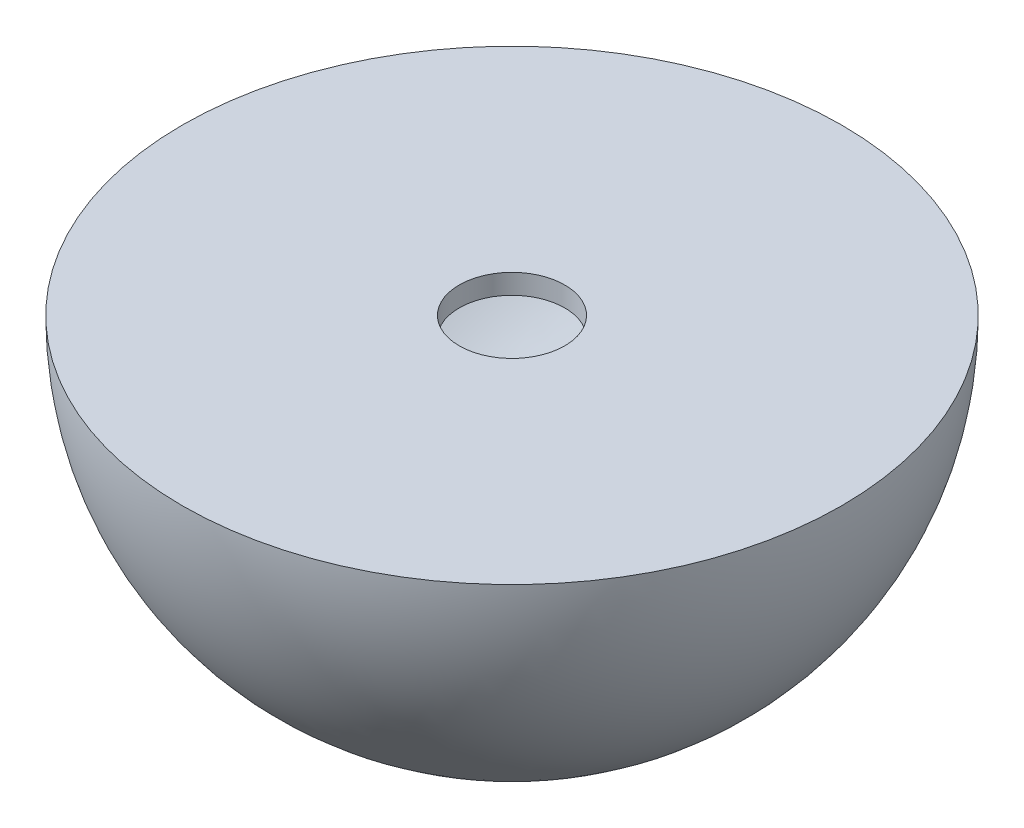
ISO-10303-21;
HEADER;
FILE_DESCRIPTION(('STEP AP214'),'2;1');
FILE_NAME('part.step','',(''),(''),'','','');
FILE_SCHEMA(('AUTOMOTIVE_DESIGN { 1 0 10303 214 1 1 1 1 }'));
ENDSEC;
DATA;
#1=APPLICATION_CONTEXT('core data for automotive mechanical design processes');
#2=APPLICATION_PROTOCOL_DEFINITION('international standard','automotive_design',2000,#1);
#3=PRODUCT_CONTEXT('',#1,'mechanical');
#4=PRODUCT('Part','Part','',(#3));
#5=PRODUCT_RELATED_PRODUCT_CATEGORY('part','',(#4));
#6=PRODUCT_DEFINITION_FORMATION('','',#4);
#7=PRODUCT_DEFINITION_CONTEXT('part definition',#1,'design');
#8=PRODUCT_DEFINITION('design','',#6,#7);
#9=PRODUCT_DEFINITION_SHAPE('','',#8);
#10=(LENGTH_UNIT() NAMED_UNIT(*) SI_UNIT(.MILLI.,.METRE.));
#11=(NAMED_UNIT(*) PLANE_ANGLE_UNIT() SI_UNIT($,.RADIAN.));
#12=(NAMED_UNIT(*) SI_UNIT($,.STERADIAN.) SOLID_ANGLE_UNIT());
#13=UNCERTAINTY_MEASURE_WITH_UNIT(LENGTH_MEASURE(1.E-05),#10,'distance_accuracy_value','');
#14=(GEOMETRIC_REPRESENTATION_CONTEXT(3) GLOBAL_UNCERTAINTY_ASSIGNED_CONTEXT((#13)) GLOBAL_UNIT_ASSIGNED_CONTEXT((#10,
#11,#12)) REPRESENTATION_CONTEXT('',''));
#15=CARTESIAN_POINT('',(0.,0.,0.));
#16=DIRECTION('',(0.,0.,1.));
#17=DIRECTION('',(1.,0.,0.));
#18=AXIS2_PLACEMENT_3D('',#15,#16,#17);
#19=CARTESIAN_POINT('',(0.,0.,0.));
#20=DIRECTION('',(0.,1.,0.));
#21=DIRECTION('',(-1.,0.,0.));
#22=AXIS2_PLACEMENT_3D('',#19,#20,#21);
#23=SPHERICAL_SURFACE('',#22,6.25);
#24=CARTESIAN_POINT('',(0.,0.,0.));
#25=DIRECTION('',(0.,1.,0.));
#26=DIRECTION('',(0.,0.,1.));
#27=AXIS2_PLACEMENT_3D('',#24,#25,#26);
#28=CIRCLE('',#27,6.25);
#29=CARTESIAN_POINT('',(0.,0.,6.25));
#30=VERTEX_POINT('',#29);
#31=EDGE_CURVE('E38',#30,#30,#28,.T.);
#32=ORIENTED_EDGE('',*,*,#31,.F.);
#33=EDGE_LOOP('',(#32));
#34=FACE_BOUND('',#33,.T.);
#35=ADVANCED_FACE('F24',(#34),#23,.T.);
#36=CARTESIAN_POINT('',(0.,0.,0.));
#37=DIRECTION('',(0.,1.,0.));
#38=DIRECTION('',(-1.,0.,0.));
#39=AXIS2_PLACEMENT_3D('',#36,#37,#38);
#40=SPHERICAL_SURFACE('',#39,5.75);
#41=CARTESIAN_POINT('',(0.,-0.377150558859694,0.));
#42=DIRECTION('',(0.,1.,0.));
#43=DIRECTION('',(0.,0.,1.));
#44=AXIS2_PLACEMENT_3D('',#41,#42,#43);
#45=CIRCLE('',#44,5.73761775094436);
#46=CARTESIAN_POINT('',(0.,-0.377150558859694,5.73761775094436));
#47=VERTEX_POINT('',#46);
#48=EDGE_CURVE('E10',#47,#47,#45,.T.);
#49=ORIENTED_EDGE('',*,*,#48,.T.);
#50=EDGE_LOOP('',(#49));
#51=FACE_BOUND('',#50,.T.);
#52=ADVANCED_FACE('F48',(#51),#40,.F.);
#53=CARTESIAN_POINT('',(-1.,-0.377150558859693,0.));
#54=DIRECTION('',(0.,-1.,0.));
#55=DIRECTION('',(0.,0.,-1.));
#56=AXIS2_PLACEMENT_3D('',#53,#54,#55);
#57=PLANE('',#56);
#58=CARTESIAN_POINT('',(0.,-0.377150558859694,0.));
#59=DIRECTION('',(0.,1.,0.));
#60=DIRECTION('',(0.,0.,1.));
#61=AXIS2_PLACEMENT_3D('',#58,#59,#60);
#62=CIRCLE('',#61,1.);
#63=CARTESIAN_POINT('',(0.,-0.377150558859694,1.));
#64=VERTEX_POINT('',#63);
#65=EDGE_CURVE('E30',#64,#64,#62,.T.);
#66=ORIENTED_EDGE('',*,*,#65,.T.);
#67=EDGE_LOOP('',(#66));
#68=FACE_BOUND('',#67,.T.);
#69=ORIENTED_EDGE('',*,*,#48,.F.);
#70=EDGE_LOOP('',(#69));
#71=FACE_BOUND('',#70,.T.);
#72=ADVANCED_FACE('F52',(#68,#71),#57,.T.);
#73=CARTESIAN_POINT('',(0.,39.4512345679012,0.));
#74=DIRECTION('',(0.,1.,0.));
#75=DIRECTION('',(0.,0.,1.));
#76=AXIS2_PLACEMENT_3D('',#73,#74,#75);
#77=CYLINDRICAL_SURFACE('',#76,1.);
#78=CARTESIAN_POINT('',(0.,0.,0.));
#79=DIRECTION('',(0.,1.,0.));
#80=DIRECTION('',(0.,0.,1.));
#81=AXIS2_PLACEMENT_3D('',#78,#79,#80);
#82=CIRCLE('',#81,1.);
#83=CARTESIAN_POINT('',(0.,0.,1.));
#84=VERTEX_POINT('',#83);
#85=EDGE_CURVE('E34',#84,#84,#82,.T.);
#86=ORIENTED_EDGE('',*,*,#85,.T.);
#87=EDGE_LOOP('',(#86));
#88=FACE_BOUND('',#87,.T.);
#89=ORIENTED_EDGE('',*,*,#65,.F.);
#90=EDGE_LOOP('',(#89));
#91=FACE_BOUND('',#90,.T.);
#92=ADVANCED_FACE('F56',(#88,#91),#77,.F.);
#93=CARTESIAN_POINT('',(-6.25,0.,0.));
#94=DIRECTION('',(0.,1.,0.));
#95=DIRECTION('',(0.,0.,1.));
#96=AXIS2_PLACEMENT_3D('',#93,#94,#95);
#97=PLANE('',#96);
#98=ORIENTED_EDGE('',*,*,#31,.T.);
#99=EDGE_LOOP('',(#98));
#100=FACE_BOUND('',#99,.T.);
#101=ORIENTED_EDGE('',*,*,#85,.F.);
#102=EDGE_LOOP('',(#101));
#103=FACE_BOUND('',#102,.T.);
#104=ADVANCED_FACE('F44',(#100,#103),#97,.T.);
#105=CLOSED_SHELL('',(#35,#52,#72,#92,#104));
#106=MANIFOLD_SOLID_BREP('B2',#105);
#107=ADVANCED_BREP_SHAPE_REPRESENTATION('',(#18,#106),#14);
#108=SHAPE_DEFINITION_REPRESENTATION(#9,#107);
ENDSEC;
END-ISO-10303-21;
